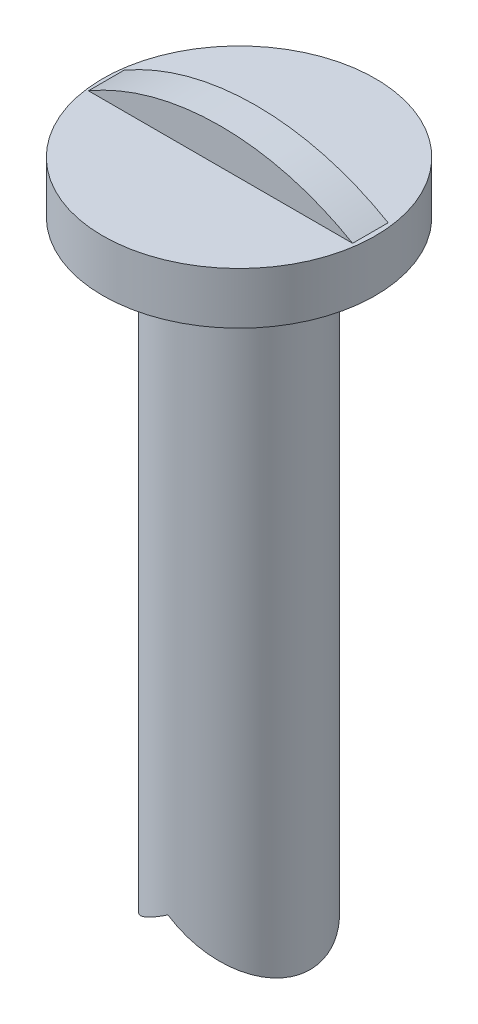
ISO-10303-21;
HEADER;
FILE_DESCRIPTION(('STEP AP214'),'2;1');
FILE_NAME('part.step','',(''),(''),'','','');
FILE_SCHEMA(('AUTOMOTIVE_DESIGN { 1 0 10303 214 1 1 1 1 }'));
ENDSEC;
DATA;
#1=APPLICATION_CONTEXT('core data for automotive mechanical design processes');
#2=APPLICATION_PROTOCOL_DEFINITION('international standard','automotive_design',2000,#1);
#3=PRODUCT_CONTEXT('',#1,'mechanical');
#4=PRODUCT('Part','Part','',(#3));
#5=PRODUCT_RELATED_PRODUCT_CATEGORY('part','',(#4));
#6=PRODUCT_DEFINITION_FORMATION('','',#4);
#7=PRODUCT_DEFINITION_CONTEXT('part definition',#1,'design');
#8=PRODUCT_DEFINITION('design','',#6,#7);
#9=PRODUCT_DEFINITION_SHAPE('','',#8);
#10=(LENGTH_UNIT() NAMED_UNIT(*) SI_UNIT(.MILLI.,.METRE.));
#11=(NAMED_UNIT(*) PLANE_ANGLE_UNIT() SI_UNIT($,.RADIAN.));
#12=(NAMED_UNIT(*) SI_UNIT($,.STERADIAN.) SOLID_ANGLE_UNIT());
#13=UNCERTAINTY_MEASURE_WITH_UNIT(LENGTH_MEASURE(1.E-05),#10,'distance_accuracy_value','');
#14=(GEOMETRIC_REPRESENTATION_CONTEXT(3) GLOBAL_UNCERTAINTY_ASSIGNED_CONTEXT((#13)) GLOBAL_UNIT_ASSIGNED_CONTEXT((#10,
#11,#12)) REPRESENTATION_CONTEXT('',''));
#15=CARTESIAN_POINT('',(0.,0.,0.));
#16=DIRECTION('',(0.,0.,1.));
#17=DIRECTION('',(1.,0.,0.));
#18=AXIS2_PLACEMENT_3D('',#15,#16,#17);
#19=CARTESIAN_POINT('',(11.5,56.3630681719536,0.));
#20=DIRECTION('',(0.,-1.,0.));
#21=DIRECTION('',(0.,0.,-1.));
#22=AXIS2_PLACEMENT_3D('',#19,#20,#21);
#23=PLANE('',#22);
#24=DIRECTION('',(0.,0.,1.));
#25=VECTOR('',#24,1.);
#26=CARTESIAN_POINT('',(11.0789577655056,56.3630681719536,0.));
#27=LINE('',#26,#25);
#28=CARTESIAN_POINT('',(11.0789577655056,56.3630681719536,-1.5));
#29=VERTEX_POINT('',#28);
#30=CARTESIAN_POINT('',(11.0789577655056,56.3630681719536,1.5));
#31=VERTEX_POINT('',#30);
#32=EDGE_CURVE('E362',#29,#31,#27,.T.);
#33=ORIENTED_EDGE('',*,*,#32,.T.);
#34=DIRECTION('',(-1.,0.,0.));
#35=VECTOR('',#34,1.);
#36=CARTESIAN_POINT('',(11.5,56.3630681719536,1.5));
#37=LINE('',#36,#35);
#38=CARTESIAN_POINT('',(-11.2093894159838,56.3630681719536,1.5));
#39=VERTEX_POINT('',#38);
#40=EDGE_CURVE('E366',#31,#39,#37,.T.);
#41=ORIENTED_EDGE('',*,*,#40,.T.);
#42=DIRECTION('',(0.,0.,1.));
#43=VECTOR('',#42,1.);
#44=CARTESIAN_POINT('',(-11.2093894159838,56.3630681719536,0.));
#45=LINE('',#44,#43);
#46=CARTESIAN_POINT('',(-11.2093894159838,56.3630681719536,-1.5));
#47=VERTEX_POINT('',#46);
#48=EDGE_CURVE('E397',#47,#39,#45,.T.);
#49=ORIENTED_EDGE('',*,*,#48,.F.);
#50=DIRECTION('',(-1.,0.,0.));
#51=VECTOR('',#50,1.);
#52=CARTESIAN_POINT('',(11.5,56.3630681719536,-1.5));
#53=LINE('',#52,#51);
#54=EDGE_CURVE('E399',#29,#47,#53,.T.);
#55=ORIENTED_EDGE('',*,*,#54,.F.);
#56=EDGE_LOOP('',(#33,#41,#49,#55));
#57=FACE_BOUND('',#56,.T.);
#58=CARTESIAN_POINT('',(0.,56.3630681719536,0.));
#59=DIRECTION('',(0.,1.,0.));
#60=DIRECTION('',(0.,0.,1.));
#61=AXIS2_PLACEMENT_3D('',#58,#59,#60);
#62=CIRCLE('',#61,11.5);
#63=CARTESIAN_POINT('',(0.,56.3630681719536,11.5));
#64=VERTEX_POINT('',#63);
#65=EDGE_CURVE('E404',#64,#64,#62,.T.);
#66=ORIENTED_EDGE('',*,*,#65,.T.);
#67=EDGE_LOOP('',(#66));
#68=FACE_BOUND('',#67,.T.);
#69=ADVANCED_FACE('F348',(#57,#68),#23,.F.);
#70=CARTESIAN_POINT('',(0.,116.543897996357,0.));
#71=DIRECTION('',(0.,1.,0.));
#72=DIRECTION('',(0.,0.,1.));
#73=AXIS2_PLACEMENT_3D('',#70,#71,#72);
#74=CYLINDRICAL_SURFACE('',#73,5.99999999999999);
#75=CARTESIAN_POINT('',(0.,3.99999999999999,0.));
#76=DIRECTION('',(-0.55470019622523,0.832050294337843,0.));
#77=DIRECTION('',(0.832050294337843,0.55470019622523,0.));
#78=AXIS2_PLACEMENT_3D('',#75,#76,#77);
#79=ELLIPSE('',#78,7.21110255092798,5.99999999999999);
#80=CARTESIAN_POINT('',(0.,4.,5.99999999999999));
#81=VERTEX_POINT('',#80);
#82=CARTESIAN_POINT('',(0.,4.,-6.));
#83=VERTEX_POINT('',#82);
#84=EDGE_CURVE('E11',#81,#83,#79,.F.);
#85=ORIENTED_EDGE('',*,*,#84,.F.);
#86=CARTESIAN_POINT('',(0.,4.,0.));
#87=DIRECTION('',(0.55470019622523,0.832050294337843,0.));
#88=DIRECTION('',(-0.832050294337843,0.55470019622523,0.));
#89=AXIS2_PLACEMENT_3D('',#86,#87,#88);
#90=ELLIPSE('',#89,7.21110255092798,5.99999999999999);
#91=EDGE_CURVE('E355',#83,#81,#90,.F.);
#92=ORIENTED_EDGE('',*,*,#91,.F.);
#93=EDGE_LOOP('',(#85,#92));
#94=FACE_BOUND('',#93,.T.);
#95=CARTESIAN_POINT('',(0.,52.,0.));
#96=DIRECTION('',(0.,1.,0.));
#97=DIRECTION('',(0.,0.,1.));
#98=AXIS2_PLACEMENT_3D('',#95,#96,#97);
#99=CIRCLE('',#98,6.);
#100=CARTESIAN_POINT('',(0.,52.,6.));
#101=VERTEX_POINT('',#100);
#102=EDGE_CURVE('E384',#101,#101,#99,.T.);
#103=ORIENTED_EDGE('',*,*,#102,.F.);
#104=EDGE_LOOP('',(#103));
#105=FACE_BOUND('',#104,.T.);
#106=ADVANCED_FACE('F379',(#94,#105),#74,.T.);
#107=CARTESIAN_POINT('',(11.5,52.,0.));
#108=DIRECTION('',(0.,-1.,0.));
#109=DIRECTION('',(0.,0.,-1.));
#110=AXIS2_PLACEMENT_3D('',#107,#108,#109);
#111=PLANE('',#110);
#112=ORIENTED_EDGE('',*,*,#102,.T.);
#113=EDGE_LOOP('',(#112));
#114=FACE_BOUND('',#113,.T.);
#115=CARTESIAN_POINT('',(0.,52.,0.));
#116=DIRECTION('',(0.,1.,0.));
#117=DIRECTION('',(0.,0.,1.));
#118=AXIS2_PLACEMENT_3D('',#115,#116,#117);
#119=CIRCLE('',#118,11.5);
#120=CARTESIAN_POINT('',(0.,52.,11.5));
#121=VERTEX_POINT('',#120);
#122=EDGE_CURVE('E407',#121,#121,#119,.T.);
#123=ORIENTED_EDGE('',*,*,#122,.F.);
#124=EDGE_LOOP('',(#123));
#125=FACE_BOUND('',#124,.T.);
#126=ADVANCED_FACE('F413',(#114,#125),#111,.T.);
#127=CARTESIAN_POINT('',(0.,116.543897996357,0.));
#128=DIRECTION('',(0.,1.,0.));
#129=DIRECTION('',(0.,0.,1.));
#130=AXIS2_PLACEMENT_3D('',#127,#128,#129);
#131=CYLINDRICAL_SURFACE('',#130,11.5);
#132=ORIENTED_EDGE('',*,*,#122,.T.);
#133=EDGE_LOOP('',(#132));
#134=FACE_BOUND('',#133,.T.);
#135=ORIENTED_EDGE('',*,*,#65,.F.);
#136=EDGE_LOOP('',(#135));
#137=FACE_BOUND('',#136,.T.);
#138=ADVANCED_FACE('F421',(#134,#137),#131,.T.);
#139=CARTESIAN_POINT('',(0.,29.6815340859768,1.5));
#140=DIRECTION('',(0.,0.,1.));
#141=DIRECTION('',(1.,0.,0.));
#142=AXIS2_PLACEMENT_3D('',#139,#140,#141);
#143=PLANE('',#142);
#144=CARTESIAN_POINT('',(-0.0652158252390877,37.1643006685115,1.5));
#145=DIRECTION('',(0.,0.,-1.));
#146=DIRECTION('',(-1.,0.,0.));
#147=AXIS2_PLACEMENT_3D('',#144,#145,#146);
#148=CIRCLE('',#147,22.1987675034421);
#149=EDGE_CURVE('E392',#39,#31,#148,.T.);
#150=ORIENTED_EDGE('',*,*,#149,.F.);
#151=ORIENTED_EDGE('',*,*,#40,.F.);
#152=EDGE_LOOP('',(#150,#151));
#153=FACE_BOUND('',#152,.T.);
#154=ADVANCED_FACE('F427',(#153),#143,.T.);
#155=CARTESIAN_POINT('',(0.,29.6815340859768,-1.5));
#156=DIRECTION('',(0.,0.,1.));
#157=DIRECTION('',(1.,0.,0.));
#158=AXIS2_PLACEMENT_3D('',#155,#156,#157);
#159=PLANE('',#158);
#160=CARTESIAN_POINT('',(-0.0652158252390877,37.1643006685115,-1.5));
#161=DIRECTION('',(0.,0.,-1.));
#162=DIRECTION('',(-1.,0.,0.));
#163=AXIS2_PLACEMENT_3D('',#160,#161,#162);
#164=CIRCLE('',#163,22.1987675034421);
#165=EDGE_CURVE('E389',#47,#29,#164,.T.);
#166=ORIENTED_EDGE('',*,*,#165,.T.);
#167=ORIENTED_EDGE('',*,*,#54,.T.);
#168=EDGE_LOOP('',(#166,#167));
#169=FACE_BOUND('',#168,.T.);
#170=ADVANCED_FACE('F431',(#169),#159,.F.);
#171=CARTESIAN_POINT('',(-0.0652158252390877,37.1643006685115,0.));
#172=DIRECTION('',(0.,0.,-1.));
#173=DIRECTION('',(-1.,0.,0.));
#174=AXIS2_PLACEMENT_3D('',#171,#172,#173);
#175=CYLINDRICAL_SURFACE('',#174,22.1987675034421);
#176=ORIENTED_EDGE('',*,*,#32,.F.);
#177=ORIENTED_EDGE('',*,*,#165,.F.);
#178=ORIENTED_EDGE('',*,*,#48,.T.);
#179=ORIENTED_EDGE('',*,*,#149,.T.);
#180=EDGE_LOOP('',(#176,#177,#178,#179));
#181=FACE_BOUND('',#180,.T.);
#182=ADVANCED_FACE('F429',(#181),#175,.T.);
#183=CARTESIAN_POINT('',(-5.99999999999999,0.,-6.5));
#184=DIRECTION('',(-0.55470019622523,0.832050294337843,0.));
#185=DIRECTION('',(-0.832050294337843,-0.55470019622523,0.));
#186=AXIS2_PLACEMENT_3D('',#183,#184,#185);
#187=PLANE('',#186);
#188=DIRECTION('',(0.,0.,1.));
#189=VECTOR('',#188,1.);
#190=CARTESIAN_POINT('',(0.,4.,-6.5));
#191=LINE('',#190,#189);
#192=EDGE_CURVE('E387',#83,#81,#191,.T.);
#193=ORIENTED_EDGE('',*,*,#192,.T.);
#194=ORIENTED_EDGE('',*,*,#84,.T.);
#195=EDGE_LOOP('',(#193,#194));
#196=FACE_BOUND('',#195,.T.);
#197=ADVANCED_FACE('F386',(#196),#187,.F.);
#198=CARTESIAN_POINT('',(0.,4.,-6.5));
#199=DIRECTION('',(0.55470019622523,0.832050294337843,0.));
#200=DIRECTION('',(-0.832050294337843,0.55470019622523,0.));
#201=AXIS2_PLACEMENT_3D('',#198,#199,#200);
#202=PLANE('',#201);
#203=ORIENTED_EDGE('',*,*,#192,.F.);
#204=ORIENTED_EDGE('',*,*,#91,.T.);
#205=EDGE_LOOP('',(#203,#204));
#206=FACE_BOUND('',#205,.T.);
#207=ADVANCED_FACE('F388',(#206),#202,.F.);
#208=CLOSED_SHELL('',(#69,#106,#126,#138,#154,#170,#182,#197,#207));
#209=MANIFOLD_SOLID_BREP('B2',#208);
#210=ADVANCED_BREP_SHAPE_REPRESENTATION('',(#18,#209),#14);
#211=SHAPE_DEFINITION_REPRESENTATION(#9,#210);
ENDSEC;
END-ISO-10303-21;
